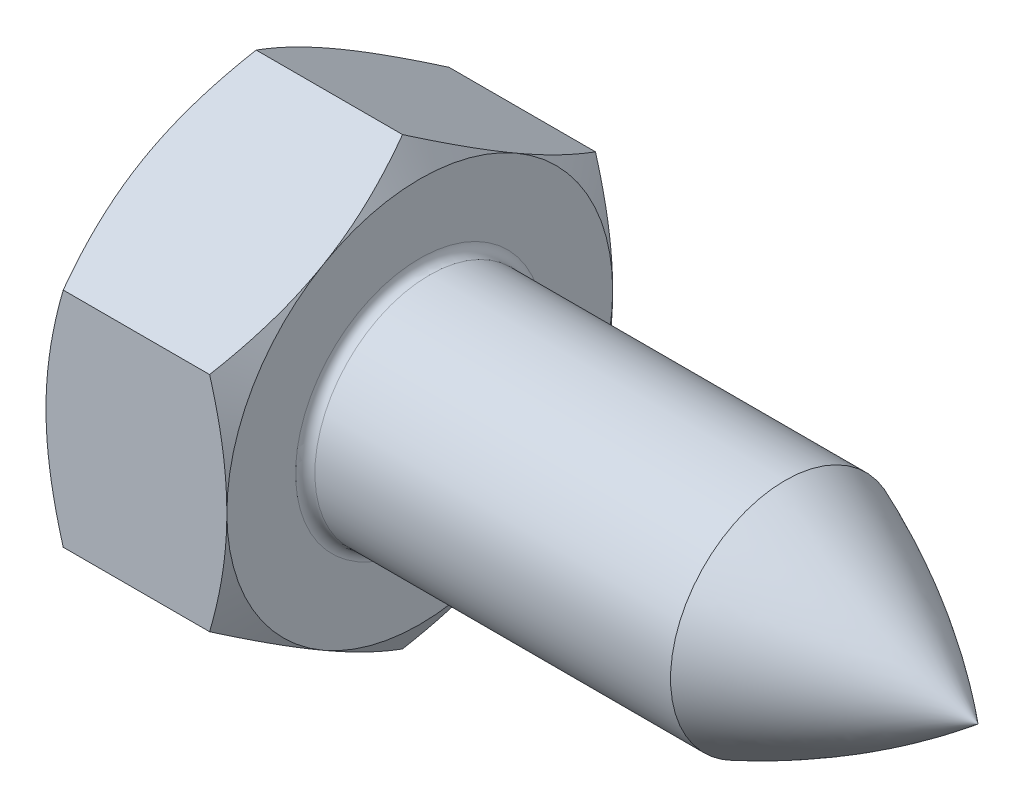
from build123d import *

# Parameters (mm, degrees)
BASEHEAD_DEPTH = 7.5
SKETCH1_W      = 23.15
SKETCH1_H      = 4.75
SKETCH7_W      = 1.6
SKETCH7_H      = 6.666666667
FILLET1_R      = 0.4


with BuildPart() as part:
    # Sketch2 → BaseHead (new body)
    with BuildSketch(Plane(origin=(0, 0, 0), x_dir=(0, 0, -1), z_dir=(1, 0, 0))):
        Polygon((0, 9.237604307), (-8, 4.618802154), (-8, -4.618802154), (0, -9.237604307), (8, -4.618802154), (8, 4.618802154), align=None)
    extrude(amount=BASEHEAD_DEPTH)

    # Sketch1 → BaseBody (revolve)
    with BuildSketch(Plane.XY, mode=Mode.PRIVATE) as basebody_sk:
        with Locations((19.075, 2.375)):
            Rectangle(SKETCH1_W, SKETCH1_H)
    revolve(basebody_sk.sketch.rotate(Axis((-9.544470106, 0, 0), (1, 0, 0)), 90), axis=Axis((-9.544470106, 0, 0), (1, 0, 0)))

    # Sketch3 → Cut-Revolve7 (revolve, cut)
    with BuildSketch(Plane.XY):
        Polygon((0, 8), (0.71453118, 9.237604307), (0, 9.237604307), align=None)
        Polygon((7.5, 9.237604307), (7.5, 8), (6.78546882, 9.237604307), align=None)
    revolve(axis=Axis((10.663764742, 0, 0), (-1, 0, 0)), mode=Mode.SUBTRACT)

    # Sketch7 → Cut-Revolve8 (revolve, cut)
    with BuildSketch(Plane.XY, mode=Mode.PRIVATE) as cut_revolve8_sk:
        with Locations((0.7, 3.333333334)):
            Rectangle(SKETCH7_W, SKETCH7_H)
    revolve(cut_revolve8_sk.sketch.rotate(Axis((0, 0, 0), (-1, 0, 0)), 90), axis=Axis((0, 0, 0), (-1, 0, 0)), mode=Mode.SUBTRACT)

    # Sketch4 → Cut-Loft1 section 0
    with BuildSketch(Plane(origin=(1.5, -1.114749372, 0.168839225), x_dir=(0, 0, 1), z_dir=(-1, 0, 0)), mode=Mode.PRIVATE) as cut_loft1_s0:
        with BuildLine():
            Line((0.551160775, 4.714749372), (-0.888839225, 4.714749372))
            Line((-0.888839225, 4.714749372), (-0.888839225, 1.834749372))
            Line((-0.888839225, 1.834749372), (-3.768839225, 1.834749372))
            Line((-3.768839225, 1.834749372), (-3.768839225, 0.394749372))
            Line((-3.768839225, 0.394749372), (-0.888839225, 0.394749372))
            Line((-0.888839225, 0.394749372), (-0.888839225, -2.485250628))
            Line((-0.888839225, -2.485250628), (0.551160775, -2.485250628))
            Line((0.551160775, -2.485250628), (0.551160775, 0.394749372))
            Line((0.551160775, 0.394749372), (3.431160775, 0.394749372))
            Line((3.431160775, 0.394749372), (3.431160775, 1.834749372))
            Line((3.431160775, 1.834749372), (0.551160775, 1.834749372))
            Line((0.551160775, 1.834749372), (0.551160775, 4.714749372))
        make_face()
    loft([Vertex(7.5, 0, 0), cut_loft1_s0.sketch], mode=Mode.SUBTRACT)

    # Fillet1
    fillet1_edges = [part.edges().sort_by_distance(p)[0] for p in [
        (7.5, 0, -4.75),
    ]]
    fillet(fillet1_edges, radius=FILLET1_R)

    # Sketch5 → Cut-Revolve1 (revolve, cut)
    with BuildSketch(Plane.XY, mode=Mode.PRIVATE) as cut_revolve1_sk:
        Polygon((26.45, -4.75), (28.55, -4.75), (30.65, -4.225), (30.65, -5.25), (26.45, -5.25), align=None)
    revolve(cut_revolve1_sk.sketch.rotate(Axis((31.978193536, 0, 0), (-1, 0, 0)), 180), axis=Axis((31.978193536, 0, 0), (-1, 0, 0)), mode=Mode.SUBTRACT)

    # Sketch6 → Cut-Revolve6 (revolve, cut)
    with BuildSketch(Plane.XY, mode=Mode.PRIVATE) as cut_revolve6_sk:
        with BuildLine():
            Line((30.65, 0), (31.15, 0))
            Line((31.15, 0), (31.15, -4.75))
            Line((31.15, -4.75), (30.65, -4.75))
            Line((30.65, -4.75), (22.65, -4.75))
            ThreePointArc((22.65, -4.75), (26.823552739, -2.66729935), (30.65, 0))
        make_face()
    revolve(cut_revolve6_sk.sketch.rotate(Axis((33.390663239, 0, 0), (-1, 0, 0)), 180), axis=Axis((33.390663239, 0, 0), (-1, 0, 0)), mode=Mode.SUBTRACT)


solid = part.part
